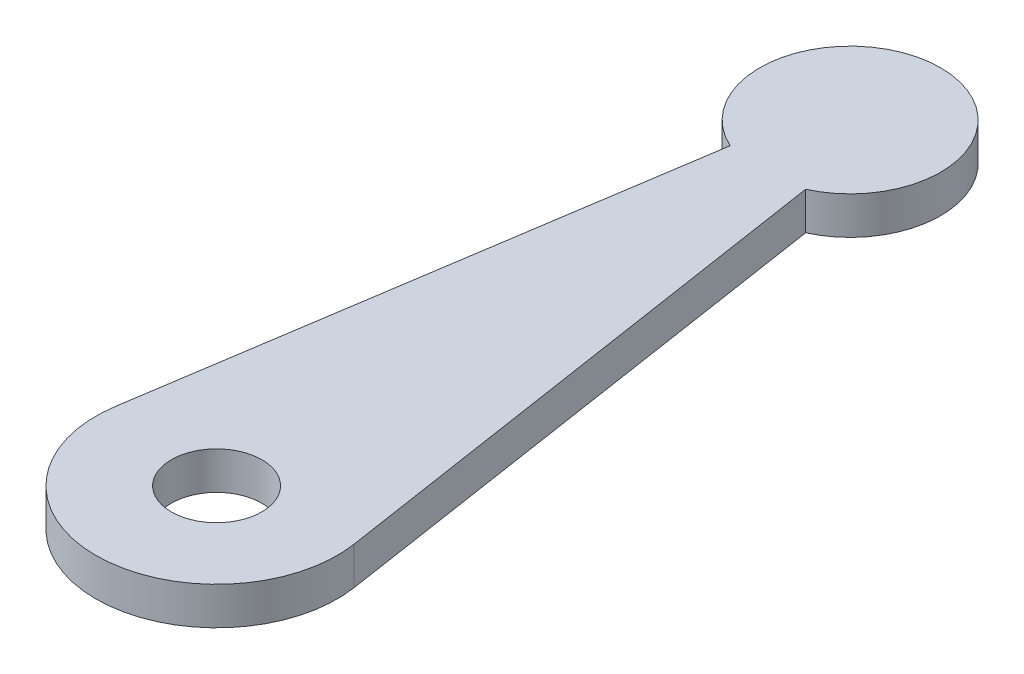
from build123d import *

# Parameters (mm, degrees)
SKETCH1_R      = 3
EXTRUDE1_DEPTH = 2.5


with BuildPart() as part:
    # Sketch1 → Extrude1 (new body)
    with BuildSketch(Plane(origin=(0, 0, 0), x_dir=(1, 0, 0), z_dir=(0, 1, 0))):
        with BuildLine():
            Line((-2.500751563, 36.54575895), (-7.907948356, 1.210104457))
            ThreePointArc((-7.907948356, 1.210104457), (0, -8), (7.907948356, 1.210104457))
            Line((7.907948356, 1.210104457), (2.500490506, 36.54575895))
            ThreePointArc((2.500490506, 36.54575895), (-0.000130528, 47.999830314), (-2.500751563, 36.54575895))
        make_face()
        with Locations(Location((0, 0, 0), (0, 0, 270))):
            Circle(SKETCH1_R, mode=Mode.SUBTRACT)
    extrude(amount=EXTRUDE1_DEPTH)


solid = part.part
